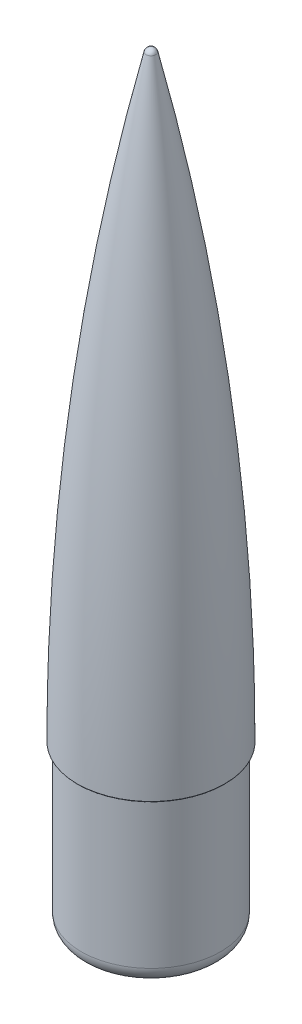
ISO-10303-21;
HEADER;
FILE_DESCRIPTION(('STEP AP214'),'2;1');
FILE_NAME('part.step','',(''),(''),'','','');
FILE_SCHEMA(('AUTOMOTIVE_DESIGN { 1 0 10303 214 1 1 1 1 }'));
ENDSEC;
DATA;
#1=APPLICATION_CONTEXT('core data for automotive mechanical design processes');
#2=APPLICATION_PROTOCOL_DEFINITION('international standard','automotive_design',2000,#1);
#3=PRODUCT_CONTEXT('',#1,'mechanical');
#4=PRODUCT('Part','Part','',(#3));
#5=PRODUCT_RELATED_PRODUCT_CATEGORY('part','',(#4));
#6=PRODUCT_DEFINITION_FORMATION('','',#4);
#7=PRODUCT_DEFINITION_CONTEXT('part definition',#1,'design');
#8=PRODUCT_DEFINITION('design','',#6,#7);
#9=PRODUCT_DEFINITION_SHAPE('','',#8);
#10=(LENGTH_UNIT() NAMED_UNIT(*) SI_UNIT(.MILLI.,.METRE.));
#11=(NAMED_UNIT(*) PLANE_ANGLE_UNIT() SI_UNIT($,.RADIAN.));
#12=(NAMED_UNIT(*) SI_UNIT($,.STERADIAN.) SOLID_ANGLE_UNIT());
#13=UNCERTAINTY_MEASURE_WITH_UNIT(LENGTH_MEASURE(1.E-05),#10,'distance_accuracy_value','');
#14=(GEOMETRIC_REPRESENTATION_CONTEXT(3) GLOBAL_UNCERTAINTY_ASSIGNED_CONTEXT((#13)) GLOBAL_UNIT_ASSIGNED_CONTEXT((#10,
#11,#12)) REPRESENTATION_CONTEXT('',''));
#15=CARTESIAN_POINT('',(0.,0.,0.));
#16=DIRECTION('',(0.,0.,1.));
#17=DIRECTION('',(1.,0.,0.));
#18=AXIS2_PLACEMENT_3D('',#15,#16,#17);
#19=CARTESIAN_POINT('',(0.,-54.9548794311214,0.));
#20=DIRECTION('',(0.,1.,0.));
#21=DIRECTION('',(0.,0.,1.));
#22=AXIS2_PLACEMENT_3D('',#19,#20,#21);
#23=TOROIDAL_SURFACE('',#22,18.6074794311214,6.51312056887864);
#24=CARTESIAN_POINT('',(0.,-54.9548794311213,0.));
#25=DIRECTION('',(0.,1.,0.));
#26=DIRECTION('',(0.,0.,1.));
#27=AXIS2_PLACEMENT_3D('',#24,#25,#26);
#28=CIRCLE('',#27,25.1206);
#29=CARTESIAN_POINT('',(0.,-54.9548794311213,25.1206));
#30=VERTEX_POINT('',#29);
#31=EDGE_CURVE('E74',#30,#30,#28,.T.);
#32=ORIENTED_EDGE('',*,*,#31,.T.);
#33=EDGE_LOOP('',(#32));
#34=FACE_BOUND('',#33,.T.);
#35=CARTESIAN_POINT('',(0.,-61.468,0.));
#36=DIRECTION('',(0.,1.,0.));
#37=DIRECTION('',(0.,0.,1.));
#38=AXIS2_PLACEMENT_3D('',#35,#36,#37);
#39=CIRCLE('',#38,18.6074794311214);
#40=CARTESIAN_POINT('',(0.,-61.468,18.6074794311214));
#41=VERTEX_POINT('',#40);
#42=EDGE_CURVE('E44',#41,#41,#39,.T.);
#43=ORIENTED_EDGE('',*,*,#42,.F.);
#44=EDGE_LOOP('',(#43));
#45=FACE_BOUND('',#44,.T.);
#46=ADVANCED_FACE('F33',(#34,#45),#23,.F.);
#47=CARTESIAN_POINT('',(0.,-61.468,0.));
#48=DIRECTION('',(0.,1.,0.));
#49=DIRECTION('',(0.,0.,1.));
#50=AXIS2_PLACEMENT_3D('',#47,#48,#49);
#51=PLANE('',#50);
#52=ORIENTED_EDGE('',*,*,#42,.T.);
#53=EDGE_LOOP('',(#52));
#54=FACE_BOUND('',#53,.T.);
#55=CARTESIAN_POINT('',(0.,-61.468,0.));
#56=DIRECTION('',(0.,1.,0.));
#57=DIRECTION('',(0.,0.,1.));
#58=AXIS2_PLACEMENT_3D('',#55,#56,#57);
#59=CIRCLE('',#58,2.84555728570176);
#60=CARTESIAN_POINT('',(0.,-61.468,2.84555728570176));
#61=VERTEX_POINT('',#60);
#62=EDGE_CURVE('E48',#61,#61,#59,.T.);
#63=ORIENTED_EDGE('',*,*,#62,.F.);
#64=EDGE_LOOP('',(#63));
#65=FACE_BOUND('',#64,.T.);
#66=ADVANCED_FACE('F94',(#54,#65),#51,.T.);
#67=CARTESIAN_POINT('',(0.,241.3,0.));
#68=DIRECTION('',(0.,1.,0.));
#69=DIRECTION('',(0.,0.,1.));
#70=AXIS2_PLACEMENT_3D('',#67,#68,#69);
#71=CYLINDRICAL_SURFACE('',#70,2.84555728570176);
#72=ORIENTED_EDGE('',*,*,#62,.T.);
#73=EDGE_LOOP('',(#72));
#74=FACE_BOUND('',#73,.T.);
#75=CARTESIAN_POINT('',(0.,-63.5,0.));
#76=DIRECTION('',(0.,1.,0.));
#77=DIRECTION('',(0.,0.,1.));
#78=AXIS2_PLACEMENT_3D('',#75,#76,#77);
#79=CIRCLE('',#78,2.84555728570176);
#80=CARTESIAN_POINT('',(0.,-63.5,2.84555728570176));
#81=VERTEX_POINT('',#80);
#82=EDGE_CURVE('E53',#81,#81,#79,.T.);
#83=ORIENTED_EDGE('',*,*,#82,.F.);
#84=EDGE_LOOP('',(#83));
#85=FACE_BOUND('',#84,.T.);
#86=ADVANCED_FACE('F98',(#74,#85),#71,.F.);
#87=CARTESIAN_POINT('',(0.,-63.5,0.));
#88=DIRECTION('',(0.,-1.,0.));
#89=DIRECTION('',(0.,0.,-1.));
#90=AXIS2_PLACEMENT_3D('',#87,#88,#89);
#91=PLANE('',#90);
#92=ORIENTED_EDGE('',*,*,#82,.T.);
#93=EDGE_LOOP('',(#92));
#94=FACE_BOUND('',#93,.T.);
#95=CARTESIAN_POINT('',(0.,-63.5,0.));
#96=DIRECTION('',(0.,1.,0.));
#97=DIRECTION('',(0.,0.,1.));
#98=AXIS2_PLACEMENT_3D('',#95,#96,#97);
#99=CIRCLE('',#98,20.8613704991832);
#100=CARTESIAN_POINT('',(0.,-63.5,20.8613704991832));
#101=VERTEX_POINT('',#100);
#102=EDGE_CURVE('E56',#101,#101,#99,.T.);
#103=ORIENTED_EDGE('',*,*,#102,.F.);
#104=EDGE_LOOP('',(#103));
#105=FACE_BOUND('',#104,.T.);
#106=ADVANCED_FACE('F104',(#94,#105),#91,.T.);
#107=CARTESIAN_POINT('',(0.,-57.2087704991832,0.));
#108=DIRECTION('',(0.,1.,0.));
#109=DIRECTION('',(0.,0.,1.));
#110=AXIS2_PLACEMENT_3D('',#107,#108,#109);
#111=TOROIDAL_SURFACE('',#110,20.8613704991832,6.29122950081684);
#112=CARTESIAN_POINT('',(0.,-57.2087704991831,0.));
#113=DIRECTION('',(0.,1.,0.));
#114=DIRECTION('',(0.,0.,1.));
#115=AXIS2_PLACEMENT_3D('',#112,#113,#114);
#116=CIRCLE('',#115,27.1526);
#117=CARTESIAN_POINT('',(0.,-57.2087704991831,27.1526));
#118=VERTEX_POINT('',#117);
#119=EDGE_CURVE('E59',#118,#118,#116,.T.);
#120=ORIENTED_EDGE('',*,*,#119,.F.);
#121=EDGE_LOOP('',(#120));
#122=FACE_BOUND('',#121,.T.);
#123=ORIENTED_EDGE('',*,*,#102,.T.);
#124=EDGE_LOOP('',(#123));
#125=FACE_BOUND('',#124,.T.);
#126=ADVANCED_FACE('F108',(#122,#125),#111,.T.);
#127=CARTESIAN_POINT('',(0.,241.3,0.));
#128=DIRECTION('',(0.,1.,0.));
#129=DIRECTION('',(0.,0.,1.));
#130=AXIS2_PLACEMENT_3D('',#127,#128,#129);
#131=CYLINDRICAL_SURFACE('',#130,27.1526);
#132=ORIENTED_EDGE('',*,*,#119,.T.);
#133=EDGE_LOOP('',(#132));
#134=FACE_BOUND('',#133,.T.);
#135=CARTESIAN_POINT('',(0.,0.,0.));
#136=DIRECTION('',(0.,1.,0.));
#137=DIRECTION('',(0.,0.,1.));
#138=AXIS2_PLACEMENT_3D('',#135,#136,#137);
#139=CIRCLE('',#138,27.1526);
#140=CARTESIAN_POINT('',(0.,0.,27.1526));
#141=VERTEX_POINT('',#140);
#142=EDGE_CURVE('E62',#141,#141,#139,.T.);
#143=ORIENTED_EDGE('',*,*,#142,.F.);
#144=EDGE_LOOP('',(#143));
#145=FACE_BOUND('',#144,.T.);
#146=ADVANCED_FACE('F112',(#134,#145),#131,.T.);
#147=CARTESIAN_POINT('',(0.,0.,0.));
#148=DIRECTION('',(0.,1.,0.));
#149=DIRECTION('',(0.,0.,1.));
#150=AXIS2_PLACEMENT_3D('',#147,#148,#149);
#151=PLANE('',#150);
#152=CARTESIAN_POINT('',(0.,0.,0.));
#153=DIRECTION('',(0.,1.,0.));
#154=DIRECTION('',(0.,0.,1.));
#155=AXIS2_PLACEMENT_3D('',#152,#153,#154);
#156=CIRCLE('',#155,28.4479686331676);
#157=CARTESIAN_POINT('',(0.,0.,28.4479686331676));
#158=VERTEX_POINT('',#157);
#159=EDGE_CURVE('E10',#158,#158,#156,.F.);
#160=ORIENTED_EDGE('',*,*,#159,.T.);
#161=EDGE_LOOP('',(#160));
#162=FACE_BOUND('',#161,.T.);
#163=ORIENTED_EDGE('',*,*,#142,.T.);
#164=EDGE_LOOP('',(#163));
#165=FACE_BOUND('',#164,.T.);
#166=ADVANCED_FACE('F116',(#162,#165),#151,.F.);
#167=CARTESIAN_POINT('',(0.,0.,0.));
#168=DIRECTION('',(0.,1.,0.));
#169=DIRECTION('',(0.,0.,1.));
#170=AXIS2_PLACEMENT_3D('',#167,#168,#169);
#171=DEGENERATE_TOROIDAL_SURFACE('',#170,999.963159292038,1028.66515929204,.F.);
#172=CARTESIAN_POINT('',(0.,0.254062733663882,0.));
#173=DIRECTION('',(0.,-1.,0.));
#174=DIRECTION('',(0.,0.,-1.));
#175=AXIS2_PLACEMENT_3D('',#172,#173,#174);
#176=CIRCLE('',#175,28.7019686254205);
#177=CARTESIAN_POINT('',(0.,0.254062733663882,-28.7019686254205));
#178=VERTEX_POINT('',#177);
#179=EDGE_CURVE('E40',#178,#178,#176,.F.);
#180=ORIENTED_EDGE('',*,*,#179,.T.);
#181=EDGE_LOOP('',(#180));
#182=FACE_BOUND('',#181,.T.);
#183=CARTESIAN_POINT('',(0.,233.178356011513,0.));
#184=DIRECTION('',(0.,1.,0.));
#185=DIRECTION('',(0.,0.,1.));
#186=AXIS2_PLACEMENT_3D('',#183,#184,#185);
#187=CIRCLE('',#186,1.92499026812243);
#188=CARTESIAN_POINT('',(0.,233.178356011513,1.92499026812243));
#189=VERTEX_POINT('',#188);
#190=EDGE_CURVE('E65',#189,#189,#187,.T.);
#191=ORIENTED_EDGE('',*,*,#190,.F.);
#192=EDGE_LOOP('',(#191));
#193=FACE_BOUND('',#192,.T.);
#194=ADVANCED_FACE('F120',(#182,#193),#171,.F.);
#195=CARTESIAN_POINT('',(0.,232.730335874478,0.));
#196=DIRECTION('',(0.,1.,0.));
#197=DIRECTION('',(1.,0.,0.));
#198=AXIS2_PLACEMENT_3D('',#195,#196,#197);
#199=SPHERICAL_SURFACE('',#198,1.9764386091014);
#200=ORIENTED_EDGE('',*,*,#190,.T.);
#201=EDGE_LOOP('',(#200));
#202=FACE_BOUND('',#201,.T.);
#203=ADVANCED_FACE('F123',(#202),#199,.T.);
#204=CARTESIAN_POINT('',(0.,227.797723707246,0.));
#205=DIRECTION('',(0.,1.,0.));
#206=DIRECTION('',(1.,0.,0.));
#207=AXIS2_PLACEMENT_3D('',#204,#205,#206);
#208=SPHERICAL_SURFACE('',#207,1.12410877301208);
#209=CARTESIAN_POINT('',(0.,228.051297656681,0.));
#210=DIRECTION('',(0.,1.,0.));
#211=DIRECTION('',(0.,0.,1.));
#212=AXIS2_PLACEMENT_3D('',#209,#210,#211);
#213=CIRCLE('',#212,1.09513505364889);
#214=CARTESIAN_POINT('',(0.,228.051297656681,1.09513505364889));
#215=VERTEX_POINT('',#214);
#216=EDGE_CURVE('E68',#215,#215,#213,.T.);
#217=ORIENTED_EDGE('',*,*,#216,.F.);
#218=EDGE_LOOP('',(#217));
#219=FACE_BOUND('',#218,.T.);
#220=ADVANCED_FACE('F90',(#219),#208,.F.);
#221=CARTESIAN_POINT('',(0.,-1.1047214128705E-13,0.));
#222=DIRECTION('',(0.,1.,0.));
#223=DIRECTION('',(0.,0.,1.));
#224=AXIS2_PLACEMENT_3D('',#221,#222,#223);
#225=DEGENERATE_TOROIDAL_SURFACE('',#224,983.812702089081,1010.96530208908,.F.);
#226=ORIENTED_EDGE('',*,*,#216,.T.);
#227=EDGE_LOOP('',(#226));
#228=FACE_BOUND('',#227,.T.);
#229=CARTESIAN_POINT('',(0.,64.0658564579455,0.));
#230=DIRECTION('',(0.,1.,0.));
#231=DIRECTION('',(0.,0.,1.));
#232=AXIS2_PLACEMENT_3D('',#229,#230,#231);
#233=CIRCLE('',#232,25.1205999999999);
#234=CARTESIAN_POINT('',(0.,64.0658564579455,25.1205999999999));
#235=VERTEX_POINT('',#234);
#236=EDGE_CURVE('E71',#235,#235,#233,.T.);
#237=ORIENTED_EDGE('',*,*,#236,.F.);
#238=EDGE_LOOP('',(#237));
#239=FACE_BOUND('',#238,.T.);
#240=ADVANCED_FACE('F82',(#228,#239),#225,.T.);
#241=CARTESIAN_POINT('',(0.,241.3,0.));
#242=DIRECTION('',(0.,1.,0.));
#243=DIRECTION('',(0.,0.,1.));
#244=AXIS2_PLACEMENT_3D('',#241,#242,#243);
#245=CYLINDRICAL_SURFACE('',#244,25.1206);
#246=ORIENTED_EDGE('',*,*,#236,.T.);
#247=EDGE_LOOP('',(#246));
#248=FACE_BOUND('',#247,.T.);
#249=ORIENTED_EDGE('',*,*,#31,.F.);
#250=EDGE_LOOP('',(#249));
#251=FACE_BOUND('',#250,.T.);
#252=ADVANCED_FACE('F80',(#248,#251),#245,.F.);
#253=CARTESIAN_POINT('',(0.,0.254,0.));
#254=DIRECTION('',(0.,1.,0.));
#255=DIRECTION('',(0.,0.,1.));
#256=AXIS2_PLACEMENT_3D('',#253,#254,#255);
#257=TOROIDAL_SURFACE('',#256,28.4479686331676,0.254);
#258=ORIENTED_EDGE('',*,*,#159,.F.);
#259=EDGE_LOOP('',(#258));
#260=FACE_BOUND('',#259,.T.);
#261=ORIENTED_EDGE('',*,*,#179,.F.);
#262=EDGE_LOOP('',(#261));
#263=FACE_BOUND('',#262,.T.);
#264=ADVANCED_FACE('F35',(#260,#263),#257,.T.);
#265=CLOSED_SHELL('',(#46,#66,#86,#106,#126,#146,#166,#194,#203,#220,#240,#252,#264));
#266=MANIFOLD_SOLID_BREP('B2',#265);
#267=ADVANCED_BREP_SHAPE_REPRESENTATION('',(#18,#266),#14);
#268=SHAPE_DEFINITION_REPRESENTATION(#9,#267);
ENDSEC;
END-ISO-10303-21;
